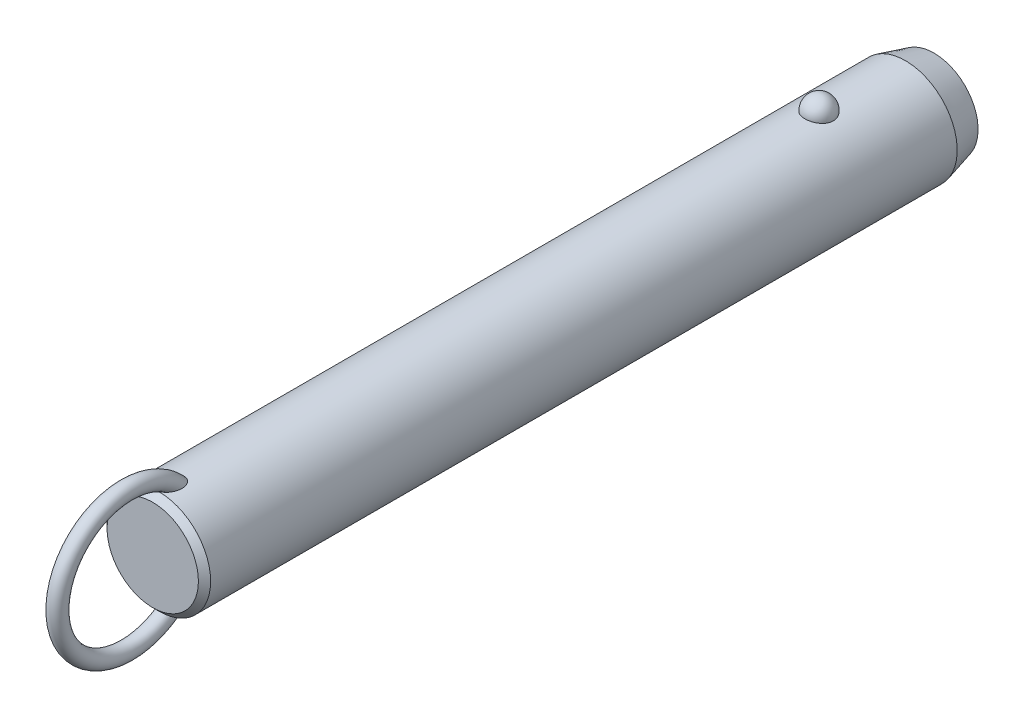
ISO-10303-21;
HEADER;
FILE_DESCRIPTION(('STEP AP214'),'2;1');
FILE_NAME('part.step','',(''),(''),'','','');
FILE_SCHEMA(('AUTOMOTIVE_DESIGN { 1 0 10303 214 1 1 1 1 }'));
ENDSEC;
DATA;
#1=APPLICATION_CONTEXT('core data for automotive mechanical design processes');
#2=APPLICATION_PROTOCOL_DEFINITION('international standard','automotive_design',2000,#1);
#3=PRODUCT_CONTEXT('',#1,'mechanical');
#4=PRODUCT('Part','Part','',(#3));
#5=PRODUCT_RELATED_PRODUCT_CATEGORY('part','',(#4));
#6=PRODUCT_DEFINITION_FORMATION('','',#4);
#7=PRODUCT_DEFINITION_CONTEXT('part definition',#1,'design');
#8=PRODUCT_DEFINITION('design','',#6,#7);
#9=PRODUCT_DEFINITION_SHAPE('','',#8);
#10=(LENGTH_UNIT() NAMED_UNIT(*) SI_UNIT(.MILLI.,.METRE.));
#11=(NAMED_UNIT(*) PLANE_ANGLE_UNIT() SI_UNIT($,.RADIAN.));
#12=(NAMED_UNIT(*) SI_UNIT($,.STERADIAN.) SOLID_ANGLE_UNIT());
#13=UNCERTAINTY_MEASURE_WITH_UNIT(LENGTH_MEASURE(1.E-05),#10,'distance_accuracy_value','');
#14=(GEOMETRIC_REPRESENTATION_CONTEXT(3) GLOBAL_UNCERTAINTY_ASSIGNED_CONTEXT((#13)) GLOBAL_UNIT_ASSIGNED_CONTEXT((#10,
#11,#12)) REPRESENTATION_CONTEXT('',''));
#15=CARTESIAN_POINT('',(0.,0.,0.));
#16=DIRECTION('',(0.,0.,1.));
#17=DIRECTION('',(1.,0.,0.));
#18=AXIS2_PLACEMENT_3D('',#15,#16,#17);
#19=CARTESIAN_POINT('',(0.,0.,147.3));
#20=DIRECTION('',(0.,0.,-1.));
#21=DIRECTION('',(-1.,0.,0.));
#22=AXIS2_PLACEMENT_3D('',#19,#20,#21);
#23=CYLINDRICAL_SURFACE('',#22,12.7);
#24=CARTESIAN_POINT('',(3.46661256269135,12.2177165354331,-3.5));
#25=CARTESIAN_POINT('',(3.4666090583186,12.2177194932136,-3.30432790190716));
#26=CARTESIAN_POINT('',(3.45063567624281,12.2222841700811,-3.10861112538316));
#27=CARTESIAN_POINT('',(3.38712451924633,12.2400345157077,-2.72271899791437));
#28=CARTESIAN_POINT('',(3.33957415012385,12.2532236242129,-2.53254588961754));
#29=CARTESIAN_POINT('',(3.2141234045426,12.286724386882,-2.16324948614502));
#30=CARTESIAN_POINT('',(3.13623639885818,12.3070329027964,-1.98412136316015));
#31=CARTESIAN_POINT('',(2.95205930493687,12.3525018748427,-1.64180592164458));
#32=CARTESIAN_POINT('',(2.84577003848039,12.3776621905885,-1.47861814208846));
#33=CARTESIAN_POINT('',(2.60688050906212,12.4301712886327,-1.17190583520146));
#34=CARTESIAN_POINT('',(2.47415697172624,12.4575299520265,-1.02847897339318));
#35=CARTESIAN_POINT('',(2.18615174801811,12.5112810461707,-0.766177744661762));
#36=CARTESIAN_POINT('',(2.03087002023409,12.5376734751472,-0.64730342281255));
#37=CARTESIAN_POINT('',(1.70237334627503,12.5864761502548,-0.437732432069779));
#38=CARTESIAN_POINT('',(1.52920948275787,12.6088972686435,-0.346958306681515));
#39=CARTESIAN_POINT('',(1.16944170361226,12.6473352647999,-0.195750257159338));
#40=CARTESIAN_POINT('',(0.982839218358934,12.663352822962,-0.135313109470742));
#41=CARTESIAN_POINT('',(0.604961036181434,12.6869706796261,-0.0473241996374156));
#42=CARTESIAN_POINT('',(0.41382314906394,12.6947125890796,-0.0192185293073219));
#43=CARTESIAN_POINT('',(0.0293827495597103,12.7014203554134,0.0051725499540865));
#44=CARTESIAN_POINT('',(-0.163919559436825,12.7003870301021,0.00146092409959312));
#45=CARTESIAN_POINT('',(-0.544374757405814,12.689735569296,-0.0373939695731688));
#46=CARTESIAN_POINT('',(-0.731575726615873,12.6802364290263,-0.0721015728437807));
#47=CARTESIAN_POINT('',(-1.09733277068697,12.6538333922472,-0.171364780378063));
#48=CARTESIAN_POINT('',(-1.27588869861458,12.6369293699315,-0.235920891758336));
#49=CARTESIAN_POINT('',(-1.6204698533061,12.5973946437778,-0.393548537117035));
#50=CARTESIAN_POINT('',(-1.78641865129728,12.5747321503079,-0.486778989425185));
#51=CARTESIAN_POINT('',(-2.10030671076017,12.5261316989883,-0.699110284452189));
#52=CARTESIAN_POINT('',(-2.24824419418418,12.5001934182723,-0.818213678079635));
#53=CARTESIAN_POINT('',(-2.52491489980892,12.4472906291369,-1.08157124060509));
#54=CARTESIAN_POINT('',(-2.65324222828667,12.4203160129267,-1.22624992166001));
#55=CARTESIAN_POINT('',(-2.88410007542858,12.3687509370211,-1.53528325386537));
#56=CARTESIAN_POINT('',(-2.98662883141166,12.3441606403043,-1.69963924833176));
#57=CARTESIAN_POINT('',(-3.16432417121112,12.2998199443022,-2.04548497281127));
#58=CARTESIAN_POINT('',(-3.23917525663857,12.2801261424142,-2.22714424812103));
#59=CARTESIAN_POINT('',(-3.35800573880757,12.248167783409,-2.6009138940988));
#60=CARTESIAN_POINT('',(-3.4019860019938,12.2359030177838,-2.79302397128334));
#61=CARTESIAN_POINT('',(-3.45784812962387,12.2202347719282,-3.18140279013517));
#62=CARTESIAN_POINT('',(-3.46986123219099,12.2167950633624,-3.37765118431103));
#63=CARTESIAN_POINT('',(-3.46186273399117,12.2190638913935,-3.76943689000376));
#64=CARTESIAN_POINT('',(-3.44185196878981,12.2247721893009,-3.96497421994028));
#65=CARTESIAN_POINT('',(-3.37048652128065,12.2446381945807,-4.34881728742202));
#66=CARTESIAN_POINT('',(-3.31928253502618,12.2587552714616,-4.53715319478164));
#67=CARTESIAN_POINT('',(-3.18693461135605,12.2938237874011,-4.90231727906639));
#68=CARTESIAN_POINT('',(-3.1057895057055,12.3147754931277,-5.07914500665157));
#69=CARTESIAN_POINT('',(-2.91506431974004,12.3613125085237,-5.41732059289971));
#70=CARTESIAN_POINT('',(-2.80533587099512,12.3869217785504,-5.57858147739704));
#71=CARTESIAN_POINT('',(-2.560414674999,12.4398525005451,-5.88013283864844));
#72=CARTESIAN_POINT('',(-2.42522099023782,12.4671740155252,-6.02042254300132));
#73=CARTESIAN_POINT('',(-2.1323357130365,12.5205965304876,-6.27662798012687));
#74=CARTESIAN_POINT('',(-1.97456596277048,12.5466928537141,-6.3924554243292));
#75=CARTESIAN_POINT('',(-1.64115839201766,12.5946384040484,-6.59583547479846));
#76=CARTESIAN_POINT('',(-1.46552179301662,12.6164879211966,-6.68339001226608));
#77=CARTESIAN_POINT('',(-1.10356050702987,12.6532533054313,-6.82682153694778));
#78=CARTESIAN_POINT('',(-0.9173913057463,12.6682500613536,-6.8830698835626));
#79=CARTESIAN_POINT('',(-0.537836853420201,12.6900288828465,-6.96386887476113));
#80=CARTESIAN_POINT('',(-0.344452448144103,12.6968119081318,-6.9884232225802));
#81=CARTESIAN_POINT('',(0.0402577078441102,12.7013667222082,-7.00496469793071));
#82=CARTESIAN_POINT('',(0.231556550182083,12.6993008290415,-6.99753844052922));
#83=CARTESIAN_POINT('',(0.610105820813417,12.6867505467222,-6.9516636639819));
#84=CARTESIAN_POINT('',(0.797356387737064,12.6762664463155,-6.913216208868));
#85=CARTESIAN_POINT('',(1.16186657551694,12.6480587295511,-6.80658431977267));
#86=CARTESIAN_POINT('',(1.33915951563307,12.6303611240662,-6.73850666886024));
#87=CARTESIAN_POINT('',(1.67968518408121,12.5896027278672,-6.5745087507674));
#88=CARTESIAN_POINT('',(1.84291705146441,12.5665416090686,-6.47858678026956));
#89=CARTESIAN_POINT('',(2.15340192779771,12.5171072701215,-6.25982455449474));
#90=CARTESIAN_POINT('',(2.30037831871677,12.4906895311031,-6.13660186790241));
#91=CARTESIAN_POINT('',(2.5717412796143,12.4376567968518,-5.86739587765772));
#92=CARTESIAN_POINT('',(2.69612388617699,12.4110417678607,-5.72140858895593));
#93=CARTESIAN_POINT('',(2.92107785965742,12.360051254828,-5.40794137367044));
#94=CARTESIAN_POINT('',(3.02121329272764,12.3357209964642,-5.24014110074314));
#95=CARTESIAN_POINT('',(3.19236291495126,12.2925446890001,-4.88969865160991));
#96=CARTESIAN_POINT('',(3.26338839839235,12.2736965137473,-4.70706226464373));
#97=CARTESIAN_POINT('',(3.36788038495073,12.245404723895,-4.35469510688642));
#98=CARTESIAN_POINT('',(3.40484026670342,12.2351018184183,-4.18605935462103));
#99=CARTESIAN_POINT('',(3.45420764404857,12.2212564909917,-3.84496058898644));
#100=CARTESIAN_POINT('',(3.46661565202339,12.2177139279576,-3.67249765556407));
#101=CARTESIAN_POINT('',(3.46661256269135,12.2177165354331,-3.5));
#102=B_SPLINE_CURVE_WITH_KNOTS('',3,(#24,#25,#26,#27,#28,#29,#30,#31,#32,#33,#34,#35,#36,#37,
#38,#39,#40,#41,#42,#43,#44,#45,#46,#47,#48,#49,#50,#51,#52,#53,#54,#55,#56,#57,#58,#59,#60,#61,
#62,#63,#64,#65,#66,#67,#68,#69,#70,#71,#72,#73,#74,#75,#76,#77,#78,#79,#80,#81,#82,#83,#84,#85,
#86,#87,#88,#89,#90,#91,#92,#93,#94,#95,#96,#97,#98,#99,#100,#101),.UNSPECIFIED.,.T.,.F.,(4,2,2,
2,2,2,2,2,2,2,2,2,2,2,2,2,2,2,2,2,2,2,2,2,2,2,2,2,2,2,2,2,2,2,2,2,2,2,4),(0.,0.586396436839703,
1.17302689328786,1.7593990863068,2.34575431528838,2.93491084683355,3.52406845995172,
4.11158733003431,4.69904375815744,5.2762784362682,5.85345931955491,6.42265312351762,
6.99185659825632,7.56427334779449,8.136746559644,8.71981013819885,9.3029135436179,
9.89247258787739,10.4820150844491,11.0691335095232,11.6562366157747,12.2405256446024,
12.8248374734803,13.412244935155,13.9996740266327,14.5891883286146,15.1786623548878,
15.7609861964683,16.3432419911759,16.9148635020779,17.4864654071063,18.0560241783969,
18.6256177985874,19.2037609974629,19.7820055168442,20.3699810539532,20.957728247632,
21.4746855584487,21.9916320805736),.UNSPECIFIED.);
#103=CARTESIAN_POINT('',(3.46661256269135,12.2177165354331,-3.5));
#104=VERTEX_POINT('',#103);
#105=EDGE_CURVE('E41',#104,#104,#102,.T.);
#106=ORIENTED_EDGE('',*,*,#105,.T.);
#107=EDGE_LOOP('',(#106));
#108=FACE_BOUND('',#107,.T.);
#109=CARTESIAN_POINT('',(0.,0.,158.5));
#110=DIRECTION('',(0.,0.,1.));
#111=DIRECTION('',(1.,0.,0.));
#112=AXIS2_PLACEMENT_3D('',#109,#110,#111);
#113=CIRCLE('',#112,12.7);
#114=CARTESIAN_POINT('',(12.7,0.,158.5));
#115=VERTEX_POINT('',#114);
#116=EDGE_CURVE('E10',#115,#115,#113,.F.);
#117=ORIENTED_EDGE('',*,*,#116,.T.);
#118=EDGE_LOOP('',(#117));
#119=FACE_BOUND('',#118,.T.);
#120=CARTESIAN_POINT('',(-0.548122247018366,-12.6881662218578,152.243218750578));
#121=CARTESIAN_POINT('',(-0.648865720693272,-12.6838128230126,152.277926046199));
#122=CARTESIAN_POINT('',(-0.746398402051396,-12.6783867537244,152.322042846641));
#123=CARTESIAN_POINT('',(-0.932125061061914,-12.666091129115,152.426764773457));
#124=CARTESIAN_POINT('',(-1.02030388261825,-12.6592192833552,152.487396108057));
#125=CARTESIAN_POINT('',(-1.18487740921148,-12.6448747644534,152.621847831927));
#126=CARTESIAN_POINT('',(-1.26134296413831,-12.637406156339,152.695582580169));
#127=CARTESIAN_POINT('',(-1.4023120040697,-12.6225412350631,152.853604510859));
#128=CARTESIAN_POINT('',(-1.466814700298,-12.6151449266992,152.93789238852));
#129=CARTESIAN_POINT('',(-1.60714786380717,-12.5981718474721,153.149657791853));
#130=CARTESIAN_POINT('',(-1.67725126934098,-12.588900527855,153.280962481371));
#131=CARTESIAN_POINT('',(-1.79536591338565,-12.5725964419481,153.553247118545));
#132=CARTESIAN_POINT('',(-1.84333535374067,-12.5655679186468,153.694244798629));
#133=CARTESIAN_POINT('',(-1.93422576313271,-12.5519624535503,154.037645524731));
#134=CARTESIAN_POINT('',(-1.96788773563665,-12.5466298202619,154.242557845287));
#135=CARTESIAN_POINT('',(-1.9941399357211,-12.542463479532,154.551760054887));
#136=CARTESIAN_POINT('',(-1.99883864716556,-12.5417153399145,154.655298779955));
#137=CARTESIAN_POINT('',(-2.00078003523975,-12.5414074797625,154.86245124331));
#138=CARTESIAN_POINT('',(-1.99802449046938,-12.5418474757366,154.966064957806));
#139=CARTESIAN_POINT('',(-1.98336733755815,-12.5441750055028,155.21032076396));
#140=CARTESIAN_POINT('',(-1.96851430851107,-12.5465291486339,155.350780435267));
#141=CARTESIAN_POINT('',(-1.92707089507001,-12.5529612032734,155.629960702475));
#142=CARTESIAN_POINT('',(-1.90047458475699,-12.5570399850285,155.768680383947));
#143=CARTESIAN_POINT('',(-1.83619120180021,-12.5666008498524,156.04341135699));
#144=CARTESIAN_POINT('',(-1.79850828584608,-12.57208240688,156.179423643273));
#145=CARTESIAN_POINT('',(-1.71223796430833,-12.5841228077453,156.447842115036));
#146=CARTESIAN_POINT('',(-1.66365679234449,-12.5906810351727,156.580250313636));
#147=CARTESIAN_POINT('',(-1.57804503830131,-12.6016176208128,156.78548877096));
#148=CARTESIAN_POINT('',(-1.54477252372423,-12.6057501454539,156.859914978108));
#149=CARTESIAN_POINT('',(-1.47424480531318,-12.6141930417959,157.006839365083));
#150=CARTESIAN_POINT('',(-1.43699041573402,-12.6185033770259,157.079337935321));
#151=CARTESIAN_POINT('',(-1.35825795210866,-12.6272207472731,157.221892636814));
#152=CARTESIAN_POINT('',(-1.31678520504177,-12.6316276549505,157.291951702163));
#153=CARTESIAN_POINT('',(-1.22917793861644,-12.6404532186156,157.429070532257));
#154=CARTESIAN_POINT('',(-1.18304514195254,-12.6448718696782,157.496131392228));
#155=CARTESIAN_POINT('',(-1.07246411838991,-12.6547893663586,157.643874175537));
#156=CARTESIAN_POINT('',(-1.0064223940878,-12.6602600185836,157.723384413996));
#157=CARTESIAN_POINT('',(-0.864441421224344,-12.6707460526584,157.873169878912));
#158=CARTESIAN_POINT('',(-0.788516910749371,-12.6757620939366,157.943458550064));
#159=CARTESIAN_POINT('',(-0.652215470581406,-12.6833591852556,158.048680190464));
#160=CARTESIAN_POINT('',(-0.594982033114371,-12.6861973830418,158.087624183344));
#161=CARTESIAN_POINT('',(-0.475269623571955,-12.6912445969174,158.156489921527));
#162=CARTESIAN_POINT('',(-0.412800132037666,-12.6934547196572,158.186427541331));
#163=CARTESIAN_POINT('',(-0.295749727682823,-12.6966636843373,158.229756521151));
#164=CARTESIAN_POINT('',(-0.241949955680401,-12.6978134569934,158.245218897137));
#165=CARTESIAN_POINT('',(-0.132508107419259,-12.6994261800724,158.266884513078));
#166=CARTESIAN_POINT('',(-0.0768679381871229,-12.6998898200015,158.273097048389));
#167=CARTESIAN_POINT('',(0.0347696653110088,-12.7000752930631,158.275583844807));
#168=CARTESIAN_POINT('',(0.0907676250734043,-12.6997954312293,158.271835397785));
#169=CARTESIAN_POINT('',(0.201283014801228,-12.6985255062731,158.254788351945));
#170=CARTESIAN_POINT('',(0.255799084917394,-12.6975348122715,158.241481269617));
#171=CARTESIAN_POINT('',(0.376042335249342,-12.6946091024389,158.20203792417));
#172=CARTESIAN_POINT('',(0.440950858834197,-12.6924943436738,158.173449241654));
#173=CARTESIAN_POINT('',(0.56535027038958,-12.6875639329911,158.106323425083));
#174=CARTESIAN_POINT('',(0.624828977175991,-12.6847467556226,158.067764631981));
#175=CARTESIAN_POINT('',(0.774116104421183,-12.6767252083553,157.956949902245));
#176=CARTESIAN_POINT('',(0.859449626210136,-12.6711344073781,157.878760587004));
#177=CARTESIAN_POINT('',(1.01789440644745,-12.6593922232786,157.710943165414));
#178=CARTESIAN_POINT('',(1.09096902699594,-12.653239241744,157.621282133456));
#179=CARTESIAN_POINT('',(1.22268793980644,-12.6411674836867,157.440265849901));
#180=CARTESIAN_POINT('',(1.28193986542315,-12.6352572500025,157.349345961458));
#181=CARTESIAN_POINT('',(1.39259777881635,-12.6235401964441,157.162792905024));
#182=CARTESIAN_POINT('',(1.44399707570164,-12.6177334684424,157.067155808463));
#183=CARTESIAN_POINT('',(1.53972870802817,-12.6064093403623,156.872273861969));
#184=CARTESIAN_POINT('',(1.58405262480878,-12.6008922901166,156.773024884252));
#185=CARTESIAN_POINT('',(1.66600705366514,-12.5903187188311,156.571772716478));
#186=CARTESIAN_POINT('',(1.70363651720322,-12.5852622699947,156.469769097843));
#187=CARTESIAN_POINT('',(1.77545379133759,-12.5753406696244,156.254358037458));
#188=CARTESIAN_POINT('',(1.80903453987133,-12.5705328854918,156.140745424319));
#189=CARTESIAN_POINT('',(1.86844163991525,-12.5618400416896,155.911457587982));
#190=CARTESIAN_POINT('',(1.89426665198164,-12.5579551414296,155.795782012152));
#191=CARTESIAN_POINT('',(1.93785464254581,-12.5513030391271,155.563007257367));
#192=CARTESIAN_POINT('',(1.95562640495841,-12.5485346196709,155.445909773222));
#193=CARTESIAN_POINT('',(1.98264463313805,-12.5442934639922,155.210747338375));
#194=CARTESIAN_POINT('',(1.99189298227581,-12.5428204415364,155.09268260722));
#195=CARTESIAN_POINT('',(2.00416068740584,-12.540871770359,154.780622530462));
#196=CARTESIAN_POINT('',(1.99944433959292,-12.541631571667,154.586229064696));
#197=CARTESIAN_POINT('',(1.96113755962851,-12.5476846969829,154.200309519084));
#198=CARTESIAN_POINT('',(1.92758341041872,-12.5529723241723,154.008780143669));
#199=CARTESIAN_POINT('',(1.83934342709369,-12.5661532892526,153.682272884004));
#200=CARTESIAN_POINT('',(1.79215440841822,-12.5730485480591,153.54524997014));
#201=CARTESIAN_POINT('',(1.67676242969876,-12.588958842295,153.280445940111));
#202=CARTESIAN_POINT('',(1.60859050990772,-12.597970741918,153.152651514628));
#203=CARTESIAN_POINT('',(1.4658383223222,-12.6152829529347,152.935800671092));
#204=CARTESIAN_POINT('',(1.39525727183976,-12.6233659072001,152.84410500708));
#205=CARTESIAN_POINT('',(1.23992594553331,-12.6395676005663,152.673485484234));
#206=CARTESIAN_POINT('',(1.1551793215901,-12.6476863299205,152.594558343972));
#207=CARTESIAN_POINT('',(0.971995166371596,-12.6630846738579,152.452643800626));
#208=CARTESIAN_POINT('',(0.873456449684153,-12.6703572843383,152.389784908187));
#209=CARTESIAN_POINT('',(0.665847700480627,-12.6829569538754,152.284487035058));
#210=CARTESIAN_POINT('',(0.556784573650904,-12.688285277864,152.242034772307));
#211=CARTESIAN_POINT('',(0.347338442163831,-12.6956226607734,152.184443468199));
#212=CARTESIAN_POINT('',(0.247759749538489,-12.6979816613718,152.166399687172));
#213=CARTESIAN_POINT('',(0.047021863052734,-12.7003077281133,152.148600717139));
#214=CARTESIAN_POINT('',(-0.0541350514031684,-12.7002779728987,152.148821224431));
#215=CARTESIAN_POINT('',(-0.22141402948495,-12.6982482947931,152.164363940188));
#216=CARTESIAN_POINT('',(-0.288055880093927,-12.6969033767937,152.174666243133));
#217=CARTESIAN_POINT('',(-0.419599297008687,-12.6932369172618,152.20313489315));
#218=CARTESIAN_POINT('',(-0.484501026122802,-12.6909154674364,152.221300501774));
#219=CARTESIAN_POINT('',(-0.548122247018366,-12.6881662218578,152.243218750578));
#220=B_SPLINE_CURVE_WITH_KNOTS('',3,(#120,#121,#122,#123,#124,#125,#126,#127,#128,#129,#130,
#131,#132,#133,#134,#135,#136,#137,#138,#139,#140,#141,#142,#143,#144,#145,#146,#147,#148,#149,
#150,#151,#152,#153,#154,#155,#156,#157,#158,#159,#160,#161,#162,#163,#164,#165,#166,#167,#168,
#169,#170,#171,#172,#173,#174,#175,#176,#177,#178,#179,#180,#181,#182,#183,#184,#185,#186,#187,
#188,#189,#190,#191,#192,#193,#194,#195,#196,#197,#198,#199,#200,#201,#202,#203,#204,#205,#206,
#207,#208,#209,#210,#211,#212,#213,#214,#215,#216,#217,#218,#219),.UNSPECIFIED.,.T.,.F.,(4,2,2,
2,2,2,2,2,2,2,2,2,2,2,2,2,2,2,2,2,2,2,2,2,2,2,2,2,2,2,2,2,2,2,2,2,2,2,2,2,2,2,2,2,2,2,2,2,2,4),
(0.,0.31964225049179,0.639794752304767,0.957927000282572,1.27608021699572,1.72100165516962,
2.16675988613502,2.78630021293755,3.09705782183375,3.40774128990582,3.83096358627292,
4.25439969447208,4.67767724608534,5.1007133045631,5.34550297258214,5.59024267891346,
5.83467707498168,6.07902143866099,6.38891080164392,6.69834321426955,6.90560910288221,
7.11250749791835,7.27977315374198,7.44687060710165,7.61434932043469,7.78197685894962,
7.99365544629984,8.20579780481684,8.55147335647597,8.89816429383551,9.22375138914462,
9.54961437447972,9.87586224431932,10.202161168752,10.557587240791,10.9130746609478,
11.2681734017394,11.6231936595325,12.2046601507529,12.7853961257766,13.219164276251,
13.6522938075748,13.9989174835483,14.3454519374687,14.6946768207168,15.0436740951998,
15.3457513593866,15.6474266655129,15.8493051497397,16.0511646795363),.UNSPECIFIED.);
#221=CARTESIAN_POINT('',(-0.548122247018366,-12.6881662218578,152.243218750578));
#222=VERTEX_POINT('',#221);
#223=EDGE_CURVE('E60',#222,#222,#220,.T.);
#224=ORIENTED_EDGE('',*,*,#223,.T.);
#225=EDGE_LOOP('',(#224));
#226=FACE_BOUND('',#225,.T.);
#227=CARTESIAN_POINT('',(-0.548122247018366,12.6881662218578,152.243218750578));
#228=CARTESIAN_POINT('',(-0.459436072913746,12.6919968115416,152.212673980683));
#229=CARTESIAN_POINT('',(-0.368189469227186,12.6949996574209,152.189391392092));
#230=CARTESIAN_POINT('',(-0.183024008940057,12.6990186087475,152.158406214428));
#231=CARTESIAN_POINT('',(-0.0891049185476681,12.7000345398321,152.150704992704));
#232=CARTESIAN_POINT('',(0.0987147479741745,12.6999636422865,152.151245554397));
#233=CARTESIAN_POINT('',(0.192615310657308,12.6988761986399,152.159492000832));
#234=CARTESIAN_POINT('',(0.377658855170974,12.6947211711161,152.191551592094));
#235=CARTESIAN_POINT('',(0.468801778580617,12.6916535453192,152.215365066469));
#236=CARTESIAN_POINT('',(0.645809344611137,12.6838788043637,152.27745651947));
#237=CARTESIAN_POINT('',(0.731679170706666,12.6791733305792,152.315720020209));
#238=CARTESIAN_POINT('',(0.896315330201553,12.6686004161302,152.405120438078));
#239=CARTESIAN_POINT('',(0.97508059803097,12.6627328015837,152.456259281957));
#240=CARTESIAN_POINT('',(1.12963655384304,12.6499161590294,152.57367820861));
#241=CARTESIAN_POINT('',(1.20478673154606,12.6429194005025,152.640792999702));
#242=CARTESIAN_POINT('',(1.34448241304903,12.6288282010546,152.78522507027));
#243=CARTESIAN_POINT('',(1.40902173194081,12.621733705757,152.862548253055));
#244=CARTESIAN_POINT('',(1.55208211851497,12.6050877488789,153.059247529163));
#245=CARTESIAN_POINT('',(1.62510490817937,12.5957546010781,153.182654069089));
#246=CARTESIAN_POINT('',(1.7501904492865,12.5789823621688,153.439769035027));
#247=CARTESIAN_POINT('',(1.8022137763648,12.5715468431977,153.573496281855));
#248=CARTESIAN_POINT('',(1.90309965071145,12.5567434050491,153.898351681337));
#249=CARTESIAN_POINT('',(1.94342317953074,12.5504515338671,154.092161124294));
#250=CARTESIAN_POINT('',(1.99332997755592,12.5426147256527,154.48378810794));
#251=CARTESIAN_POINT('',(2.00285305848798,12.5410790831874,154.681612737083));
#252=CARTESIAN_POINT('',(1.99678999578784,12.5420407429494,155.016642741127));
#253=CARTESIAN_POINT('',(1.98794117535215,12.5434564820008,155.154042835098));
#254=CARTESIAN_POINT('',(1.95865119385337,12.5480641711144,155.427639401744));
#255=CARTESIAN_POINT('',(1.93820436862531,12.5512569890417,155.563835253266));
#256=CARTESIAN_POINT('',(1.88647896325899,12.5591352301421,155.834249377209));
#257=CARTESIAN_POINT('',(1.85518800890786,12.5638223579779,155.968465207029));
#258=CARTESIAN_POINT('',(1.78217886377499,12.5743868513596,156.233936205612));
#259=CARTESIAN_POINT('',(1.74046509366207,12.5802637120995,156.365192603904));
#260=CARTESIAN_POINT('',(1.66024095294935,12.5910571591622,156.586085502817));
#261=CARTESIAN_POINT('',(1.62434772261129,12.5957535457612,156.676690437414));
#262=CARTESIAN_POINT('',(1.54709009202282,12.6054762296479,156.855512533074));
#263=CARTESIAN_POINT('',(1.50572681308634,12.6105024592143,156.943730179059));
#264=CARTESIAN_POINT('',(1.41728020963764,12.620748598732,157.116932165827));
#265=CARTESIAN_POINT('',(1.37021377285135,12.625967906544,157.201925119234));
#266=CARTESIAN_POINT('',(1.26969620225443,12.6364721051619,157.368007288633));
#267=CARTESIAN_POINT('',(1.21624929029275,12.6417569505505,157.449099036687));
#268=CARTESIAN_POINT('',(1.1030441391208,12.6521331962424,157.604702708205));
#269=CARTESIAN_POINT('',(1.04340936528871,12.657226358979,157.679303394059));
#270=CARTESIAN_POINT('',(0.915919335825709,12.667090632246,157.821324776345));
#271=CARTESIAN_POINT('',(0.848064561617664,12.6718617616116,157.88874589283));
#272=CARTESIAN_POINT('',(0.717035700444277,12.67987711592,158.000624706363));
#273=CARTESIAN_POINT('',(0.655526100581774,12.6832377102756,158.046997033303));
#274=CARTESIAN_POINT('',(0.525985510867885,12.6892676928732,158.129619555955));
#275=CARTESIAN_POINT('',(0.457969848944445,12.6919386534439,158.165892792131));
#276=CARTESIAN_POINT('',(0.334859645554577,12.695691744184,158.216657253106));
#277=CARTESIAN_POINT('',(0.281116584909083,12.6970073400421,158.234373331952));
#278=CARTESIAN_POINT('',(0.171425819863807,12.6989609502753,158.260642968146));
#279=CARTESIAN_POINT('',(0.115480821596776,12.699599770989,158.269207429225));
#280=CARTESIAN_POINT('',(0.00272618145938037,12.7001251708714,158.276253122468));
#281=CARTESIAN_POINT('',(-0.0540859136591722,12.7000089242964,158.274696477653));
#282=CARTESIAN_POINT('',(-0.16654462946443,12.6990328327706,158.261600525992));
#283=CARTESIAN_POINT('',(-0.222190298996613,12.6981724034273,158.250053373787));
#284=CARTESIAN_POINT('',(-0.342018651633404,12.695562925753,158.214912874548));
#285=CARTESIAN_POINT('',(-0.405606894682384,12.6936676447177,158.18933225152));
#286=CARTESIAN_POINT('',(-0.527815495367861,12.6891754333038,158.128311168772));
#287=CARTESIAN_POINT('',(-0.586425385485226,12.6865770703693,158.092850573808));
#288=CARTESIAN_POINT('',(-0.731842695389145,12.6792129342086,157.991496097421));
#289=CARTESIAN_POINT('',(-0.81470941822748,12.6740767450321,157.9200395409));
#290=CARTESIAN_POINT('',(-0.969101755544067,12.6632083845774,157.76589007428));
#291=CARTESIAN_POINT('',(-1.04059564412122,12.6574746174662,157.683166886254));
#292=CARTESIAN_POINT('',(-1.16981116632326,12.6461638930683,157.515809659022));
#293=CARTESIAN_POINT('',(-1.22811369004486,12.6405994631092,157.431616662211));
#294=CARTESIAN_POINT('',(-1.33743405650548,12.6295007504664,157.258579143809));
#295=CARTESIAN_POINT('',(-1.38844577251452,12.6239664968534,157.169730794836));
#296=CARTESIAN_POINT('',(-1.48400702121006,12.6130898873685,156.988389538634));
#297=CARTESIAN_POINT('',(-1.52854232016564,12.6077479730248,156.895889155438));
#298=CARTESIAN_POINT('',(-1.61150113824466,12.5974127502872,156.708160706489));
#299=CARTESIAN_POINT('',(-1.64992317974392,12.5924195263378,156.612931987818));
#300=CARTESIAN_POINT('',(-1.73468589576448,12.581070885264,156.38289362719));
#301=CARTESIAN_POINT('',(-1.77831261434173,12.5749388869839,156.247066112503));
#302=CARTESIAN_POINT('',(-1.85439734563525,12.5639437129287,155.972212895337));
#303=CARTESIAN_POINT('',(-1.88684994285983,12.5590811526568,155.833185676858));
#304=CARTESIAN_POINT('',(-1.94008483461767,12.550968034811,155.55309235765));
#305=CARTESIAN_POINT('',(-1.96088706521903,12.5477147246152,155.412030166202));
#306=CARTESIAN_POINT('',(-1.99000539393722,12.5431291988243,155.128668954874));
#307=CARTESIAN_POINT('',(-1.99832911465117,12.5417958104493,154.986370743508));
#308=CARTESIAN_POINT('',(-2.00166624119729,12.5412674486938,154.657627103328));
#309=CARTESIAN_POINT('',(-1.99178843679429,12.5428579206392,154.471088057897));
#310=CARTESIAN_POINT('',(-1.94455183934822,12.5502731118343,154.10162404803));
#311=CARTESIAN_POINT('',(-1.90724032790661,12.5560905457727,153.918693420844));
#312=CARTESIAN_POINT('',(-1.81330718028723,12.5699462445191,153.604848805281));
#313=CARTESIAN_POINT('',(-1.76338820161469,12.5771273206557,153.471910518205));
#314=CARTESIAN_POINT('',(-1.64305018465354,12.593414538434,153.215681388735));
#315=CARTESIAN_POINT('',(-1.57265346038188,12.6025185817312,153.092380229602));
#316=CARTESIAN_POINT('',(-1.42634956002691,12.6198178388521,152.883564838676));
#317=CARTESIAN_POINT('',(-1.35423772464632,12.6278405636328,152.795384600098));
#318=CARTESIAN_POINT('',(-1.19645664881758,12.6437632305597,152.632107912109));
#319=CARTESIAN_POINT('',(-1.1108053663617,12.6516633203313,152.556994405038));
#320=CARTESIAN_POINT('',(-0.947219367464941,12.6648319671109,152.437811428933));
#321=CARTESIAN_POINT('',(-0.871624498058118,12.670300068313,152.390541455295));
#322=CARTESIAN_POINT('',(-0.714161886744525,12.6801492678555,152.3077413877));
#323=CARTESIAN_POINT('',(-0.632295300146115,12.684530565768,152.27220913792));
#324=CARTESIAN_POINT('',(-0.548122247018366,12.6881662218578,152.243218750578));
#325=B_SPLINE_CURVE_WITH_KNOTS('',3,(#227,#228,#229,#230,#231,#232,#233,#234,#235,#236,#237,
#238,#239,#240,#241,#242,#243,#244,#245,#246,#247,#248,#249,#250,#251,#252,#253,#254,#255,#256,
#257,#258,#259,#260,#261,#262,#263,#264,#265,#266,#267,#268,#269,#270,#271,#272,#273,#274,#275,
#276,#277,#278,#279,#280,#281,#282,#283,#284,#285,#286,#287,#288,#289,#290,#291,#292,#293,#294,
#295,#296,#297,#298,#299,#300,#301,#302,#303,#304,#305,#306,#307,#308,#309,#310,#311,#312,#313,
#314,#315,#316,#317,#318,#319,#320,#321,#322,#323,#324),.UNSPECIFIED.,.T.,.F.,(4,2,2,2,2,2,2,2,
2,2,2,2,2,2,2,2,2,2,2,2,2,2,2,2,2,2,2,2,2,2,2,2,2,2,2,2,2,2,2,2,2,2,2,2,2,2,2,2,4),(0.,
0.281328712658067,0.562682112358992,0.844117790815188,1.12555942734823,1.40671982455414,
1.68792232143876,1.98972294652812,2.29169886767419,2.72039860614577,3.14989948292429,
3.74084916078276,4.33295293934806,4.74554109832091,5.15833092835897,5.57159335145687,
5.98468079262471,6.27722775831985,6.56971484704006,6.8613560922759,7.15280542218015,
7.43927407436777,7.72572595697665,7.95635862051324,8.18646071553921,8.35559393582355,
8.52452541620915,8.69408946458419,8.86378678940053,9.06834348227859,9.27332014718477,
9.60010414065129,9.92778432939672,10.2350252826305,10.5425229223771,10.8506864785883,
11.15892440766,11.5867893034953,12.0148612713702,12.4421984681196,12.8692745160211,
13.4279365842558,13.9856380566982,14.4107062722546,14.835313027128,15.1765567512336,
15.517351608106,15.7844129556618,16.051425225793),.UNSPECIFIED.);
#326=CARTESIAN_POINT('',(-0.548122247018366,12.6881662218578,152.243218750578));
#327=VERTEX_POINT('',#326);
#328=EDGE_CURVE('E68',#327,#327,#325,.T.);
#329=ORIENTED_EDGE('',*,*,#328,.T.);
#330=EDGE_LOOP('',(#329));
#331=FACE_BOUND('',#330,.T.);
#332=CARTESIAN_POINT('',(0.,0.,-24.6999999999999));
#333=DIRECTION('',(0.,0.,-1.));
#334=DIRECTION('',(-1.,0.,0.));
#335=AXIS2_PLACEMENT_3D('',#332,#333,#334);
#336=CIRCLE('',#335,12.7);
#337=CARTESIAN_POINT('',(-12.7,0.,-24.6999999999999));
#338=VERTEX_POINT('',#337);
#339=EDGE_CURVE('E57',#338,#338,#336,.F.);
#340=ORIENTED_EDGE('',*,*,#339,.T.);
#341=EDGE_LOOP('',(#340));
#342=FACE_BOUND('',#341,.T.);
#343=ADVANCED_FACE('F37',(#108,#119,#226,#331,#342),#23,.T.);
#344=CARTESIAN_POINT('',(0.,0.,-31.7));
#345=DIRECTION('',(0.,0.,-1.));
#346=DIRECTION('',(-1.,0.,0.));
#347=AXIS2_PLACEMENT_3D('',#344,#345,#346);
#348=PLANE('',#347);
#349=CARTESIAN_POINT('',(0.,0.,-31.7));
#350=DIRECTION('',(0.,0.,-1.));
#351=DIRECTION('',(-1.,0.,0.));
#352=AXIS2_PLACEMENT_3D('',#349,#350,#351);
#353=CIRCLE('',#352,10.8243556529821);
#354=CARTESIAN_POINT('',(-10.8243556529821,0.,-31.7));
#355=VERTEX_POINT('',#354);
#356=EDGE_CURVE('E67',#355,#355,#353,.T.);
#357=ORIENTED_EDGE('',*,*,#356,.T.);
#358=EDGE_LOOP('',(#357));
#359=FACE_BOUND('',#358,.T.);
#360=ADVANCED_FACE('F86',(#359),#348,.T.);
#361=CARTESIAN_POINT('',(0.,0.,-31.7));
#362=DIRECTION('',(0.,0.,1.));
#363=DIRECTION('',(1.,0.,0.));
#364=AXIS2_PLACEMENT_3D('',#361,#362,#363);
#365=CONICAL_SURFACE('',#364,10.8243556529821,0.261799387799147);
#366=ORIENTED_EDGE('',*,*,#339,.F.);
#367=EDGE_LOOP('',(#366));
#368=FACE_BOUND('',#367,.T.);
#369=ORIENTED_EDGE('',*,*,#356,.F.);
#370=EDGE_LOOP('',(#369));
#371=FACE_BOUND('',#370,.T.);
#372=ADVANCED_FACE('F84',(#368,#371),#365,.T.);
#373=CARTESIAN_POINT('',(0.,0.,160.));
#374=DIRECTION('',(0.,0.,1.));
#375=DIRECTION('',(1.,0.,0.));
#376=AXIS2_PLACEMENT_3D('',#373,#374,#375);
#377=PLANE('',#376);
#378=CARTESIAN_POINT('',(0.,0.,160.));
#379=DIRECTION('',(0.,0.,1.));
#380=DIRECTION('',(1.,0.,0.));
#381=AXIS2_PLACEMENT_3D('',#378,#379,#380);
#382=CIRCLE('',#381,11.2);
#383=CARTESIAN_POINT('',(11.2,0.,160.));
#384=VERTEX_POINT('',#383);
#385=EDGE_CURVE('E50',#384,#384,#382,.T.);
#386=ORIENTED_EDGE('',*,*,#385,.T.);
#387=EDGE_LOOP('',(#386));
#388=FACE_BOUND('',#387,.T.);
#389=ADVANCED_FACE('F78',(#388),#377,.T.);
#390=CARTESIAN_POINT('',(0.,0.,166.35));
#391=DIRECTION('',(1.,0.,0.));
#392=DIRECTION('',(0.,0.,-1.));
#393=AXIS2_PLACEMENT_3D('',#390,#391,#392);
#394=TOROIDAL_SURFACE('',#393,17.05,2.);
#395=ORIENTED_EDGE('',*,*,#328,.F.);
#396=EDGE_LOOP('',(#395));
#397=FACE_BOUND('',#396,.T.);
#398=ORIENTED_EDGE('',*,*,#223,.F.);
#399=EDGE_LOOP('',(#398));
#400=FACE_BOUND('',#399,.T.);
#401=ADVANCED_FACE('F74',(#397,#400),#394,.T.);
#402=CARTESIAN_POINT('',(0.,0.,160.));
#403=DIRECTION('',(0.,0.,-1.));
#404=DIRECTION('',(-1.,0.,0.));
#405=AXIS2_PLACEMENT_3D('',#402,#403,#404);
#406=CONICAL_SURFACE('',#405,11.2,0.785398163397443);
#407=ORIENTED_EDGE('',*,*,#116,.F.);
#408=EDGE_LOOP('',(#407));
#409=FACE_BOUND('',#408,.T.);
#410=ORIENTED_EDGE('',*,*,#385,.F.);
#411=EDGE_LOOP('',(#410));
#412=FACE_BOUND('',#411,.T.);
#413=ADVANCED_FACE('F39',(#409,#412),#406,.T.);
#414=CARTESIAN_POINT('',(0.,12.7,-3.5));
#415=DIRECTION('',(0.,1.,0.));
#416=DIRECTION('',(0.,0.,-1.));
#417=AXIS2_PLACEMENT_3D('',#414,#415,#416);
#418=SPHERICAL_SURFACE('',#417,3.5);
#419=ORIENTED_EDGE('',*,*,#105,.F.);
#420=EDGE_LOOP('',(#419));
#421=FACE_BOUND('',#420,.T.);
#422=ADVANCED_FACE('F80',(#421),#418,.T.);
#423=CLOSED_SHELL('',(#343,#360,#372,#389,#401,#413,#422));
#424=MANIFOLD_SOLID_BREP('B2',#423);
#425=ADVANCED_BREP_SHAPE_REPRESENTATION('',(#18,#424),#14);
#426=SHAPE_DEFINITION_REPRESENTATION(#9,#425);
ENDSEC;
END-ISO-10303-21;
